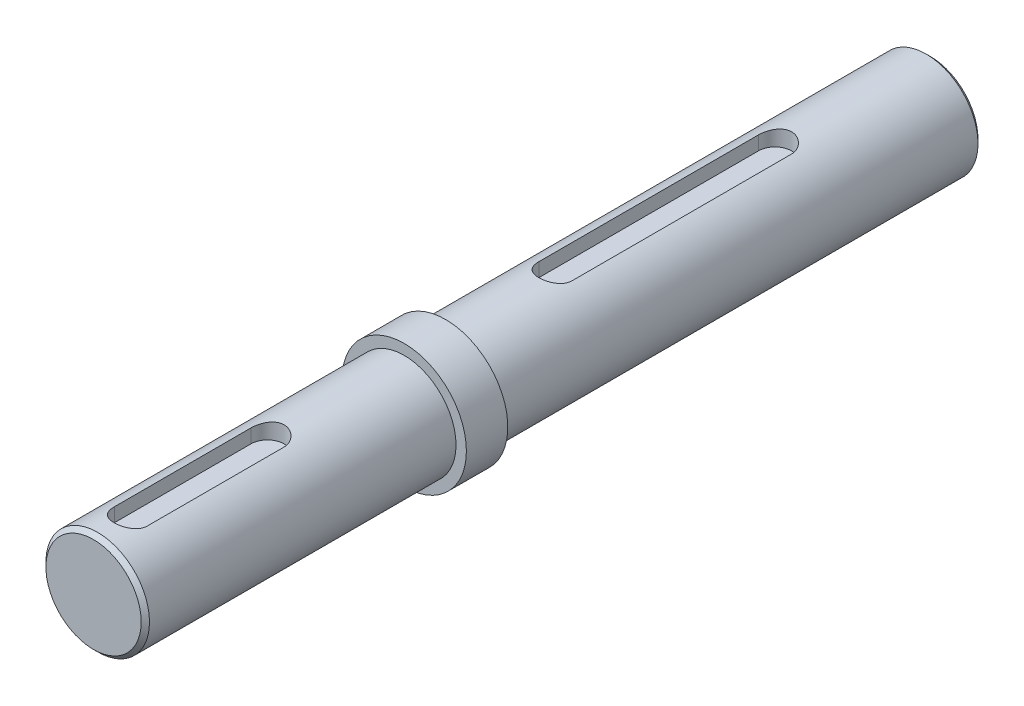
from build123d import *

# Parameters (mm, degrees)
ESQUISSE1_R                = 15
EXTRUSION1_DEPTH           = 202
ESQUISSE2_OUTSIDE_W        = 73.282
ESQUISSE2_OUTSIDE_H        = 73.282
ESQUISSE2_OUTSIDE_R        = 12.5
ENL_V_MAT_EXTRU_1_DEPTH    = 75
ESQUISSE3_OUTSIDE_W        = 73.282
ESQUISSE3_OUTSIDE_H        = 73.282
ESQUISSE3_OUTSIDE_R        = 12.5
ENL_V_MAT_EXTRU_2_DEPTH    = 117
ENL_V_MAT_EXTRU_21_DEPTH   = 4
ENL_V_MAT_EXTRU_22_DEPTH   = 4
CHANFREIN1_SIZE            = 1
TROU_TARAUD_M8X1_251_D     = 6.8
TROU_TARAUD_M8X1_251_DEPTH = 20
TROU_TARAUD_M8X1_251_TIP   = 2.042926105


with BuildPart() as part:
    # Esquisse1 → Extrusion1 (new body)
    with BuildSketch(Plane.XY):
        Circle(ESQUISSE1_R)
    extrude(amount=EXTRUSION1_DEPTH)

    # Esquisse2 outside → Enl_v. mat.-Extru.1 (cut)
    with BuildSketch(Plane.XY.offset(202)):
        Rectangle(ESQUISSE2_OUTSIDE_W, ESQUISSE2_OUTSIDE_H)
        Circle(ESQUISSE2_OUTSIDE_R, mode=Mode.SUBTRACT)
    extrude(amount=-ENL_V_MAT_EXTRU_1_DEPTH, mode=Mode.SUBTRACT)

    # Esquisse3 outside → Enl_v. mat.-Extru.2 (cut)
    with BuildSketch(Plane(origin=(0, 0, 0), x_dir=(-1, 0, 0), z_dir=(0, 0, -1))):
        Rectangle(ESQUISSE3_OUTSIDE_W, ESQUISSE3_OUTSIDE_H)
        with Locations(Location((0, 0, 0), (0, 0, 180))):
            Circle(ESQUISSE3_OUTSIDE_R, mode=Mode.SUBTRACT)
    extrude(amount=-ENL_V_MAT_EXTRU_2_DEPTH, mode=Mode.SUBTRACT)

    # Esquisse11 → Enl_v. mat.-Extru.21 (cut)
    with BuildSketch(Plane(origin=(0, 12.5, 202), x_dir=(-1, 0, 0), z_dir=(0, 1, 0))):
        with BuildLine():
            Line((-4, -9), (-4, -42))
            ThreePointArc((-4, -42), (0, -46), (4, -42))
            Line((4, -42), (4, -9))
            ThreePointArc((4, -9), (0, -5), (-4, -9))
        make_face()
    extrude(amount=-ENL_V_MAT_EXTRU_21_DEPTH, mode=Mode.SUBTRACT)

    # Esquisse12 → Enl_v. mat.-Extru.22 (cut)
    with BuildSketch(Plane(origin=(0, 12.5, 0), x_dir=(1, 0, 0), z_dir=(0, 1, 0))):
        with BuildLine():
            Line((-4, -37.5), (-4, -90.5))
            ThreePointArc((-4, -90.5), (0, -94.5), (4, -90.5))
            Line((4, -90.5), (4, -37.5))
            ThreePointArc((4, -37.5), (0, -33.5), (-4, -37.5))
        make_face()
    extrude(amount=-ENL_V_MAT_EXTRU_22_DEPTH, mode=Mode.SUBTRACT)

    # Chanfrein1
    chanfrein1_edges = [part.edges().sort_by_distance(p)[0] for p in [
        (-12.5, 0, 202),
        (-12.5, 0, 0),
    ]]
    chamfer(chanfrein1_edges, length=CHANFREIN1_SIZE)

    # Trou taraud_ M8x1.251
    with Locations(Plane(origin=(0, 0, 0), x_dir=(-1, 0, 0), z_dir=(0, 0, -1))):
        with Locations((0, 0)):
            Hole(TROU_TARAUD_M8X1_251_D / 2, depth=TROU_TARAUD_M8X1_251_DEPTH)
            with Locations((0, 0, -(TROU_TARAUD_M8X1_251_DEPTH + TROU_TARAUD_M8X1_251_TIP / 2))):  # 118° drill point
                Cone(0, TROU_TARAUD_M8X1_251_D / 2, TROU_TARAUD_M8X1_251_TIP, mode=Mode.SUBTRACT)


solid = part.part
